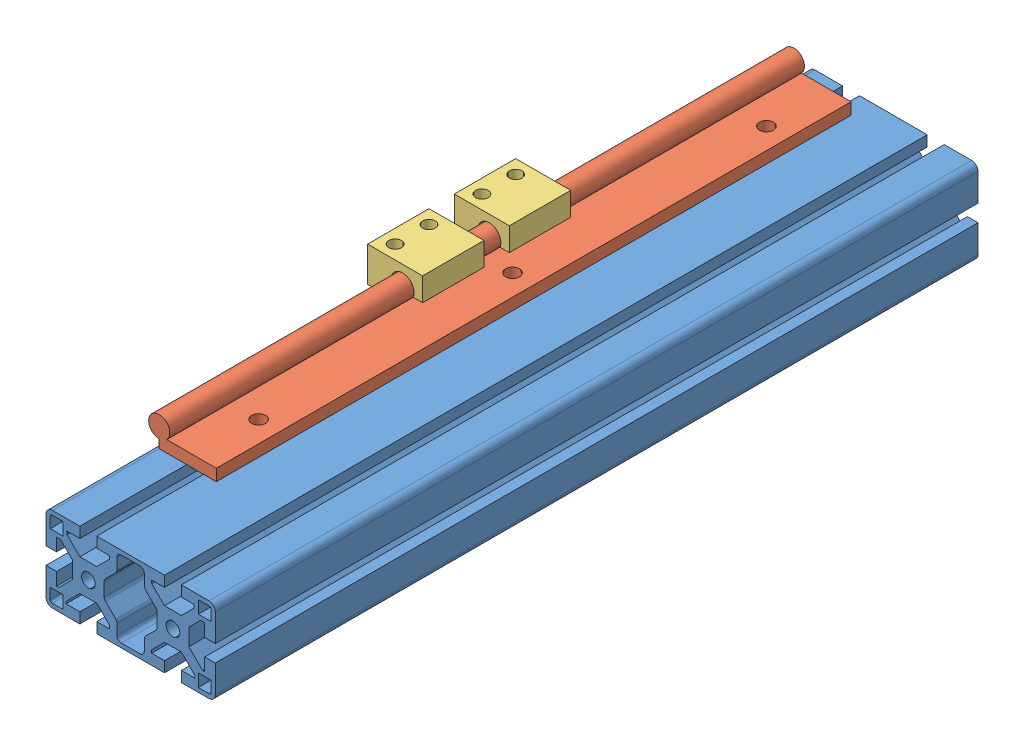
SolidWorks assembly X-Lateral deslizante DRCH.SLDASM, configuration Predeterminado (file format 3800). Lengths in mm.
Overall size (93.5 58 360.5).
5 component instances, 3 part files, 0 mates.
Components (placement in the parent):
- X-Perfil AL estructura 40x80x360-1: X-Perfil AL estructura 40x80x360.SLDPRT [Predeterminado] at origin size (80 40 360.5)
- X-Deslizadera con patin-1: X-Deslizadera con patin.SLDASM [Predeterminado] at (-3.5 0 0) size (43.5 18 300)
  - X-Deslizadera simple-1: X-Deslizadera simple.SLDPRT [Predeterminado] at (0 22.75 10) size (32 14 300)
  - X-Patin-1: X-Patin.SLDPRT [Predeterminado] at (-17 29.75 125) size (26 16.5 29)
  - X-Patin-2: X-Patin.SLDPRT [Predeterminado] at (-17 29.75 166) size (26 16.5 29)
